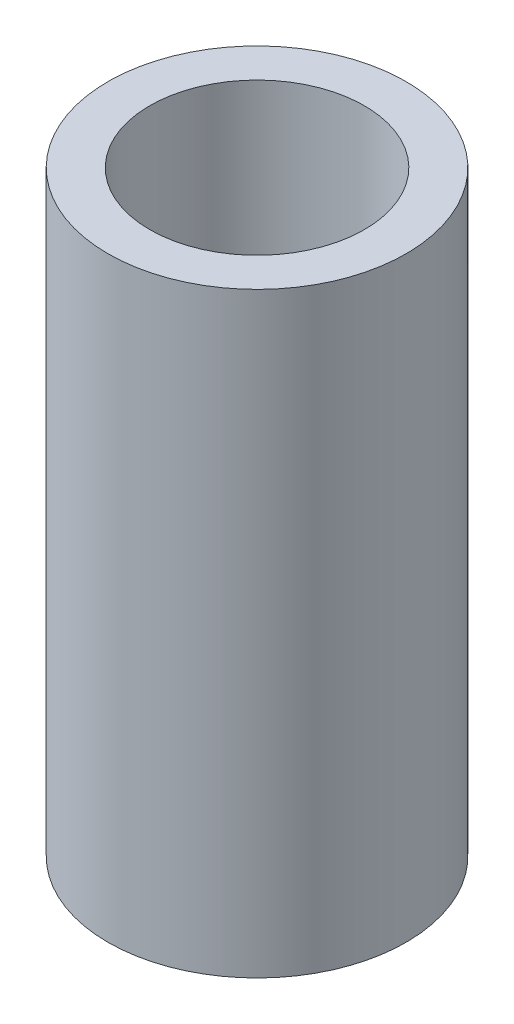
from build123d import *

# Parameters (mm, degrees)
SKETCH1_R           = 12.5
SKETCH1_R_2         = 9
BOSS_EXTRUDE1_DEPTH = 50


with BuildPart() as part:
    # Sketch1 → Boss-Extrude1 (new body)
    with BuildSketch(Plane(origin=(0, 0, 0), x_dir=(1, 0, 0), z_dir=(0, 1, 0))):
        with Locations(Location((0, 0, 0), (0, 0, 270))):
            Circle(SKETCH1_R)
        with Locations(Location((0, 0, 0), (0, 0, 270))):
            Circle(SKETCH1_R_2, mode=Mode.SUBTRACT)
    extrude(amount=BOSS_EXTRUDE1_DEPTH)


solid = part.part
